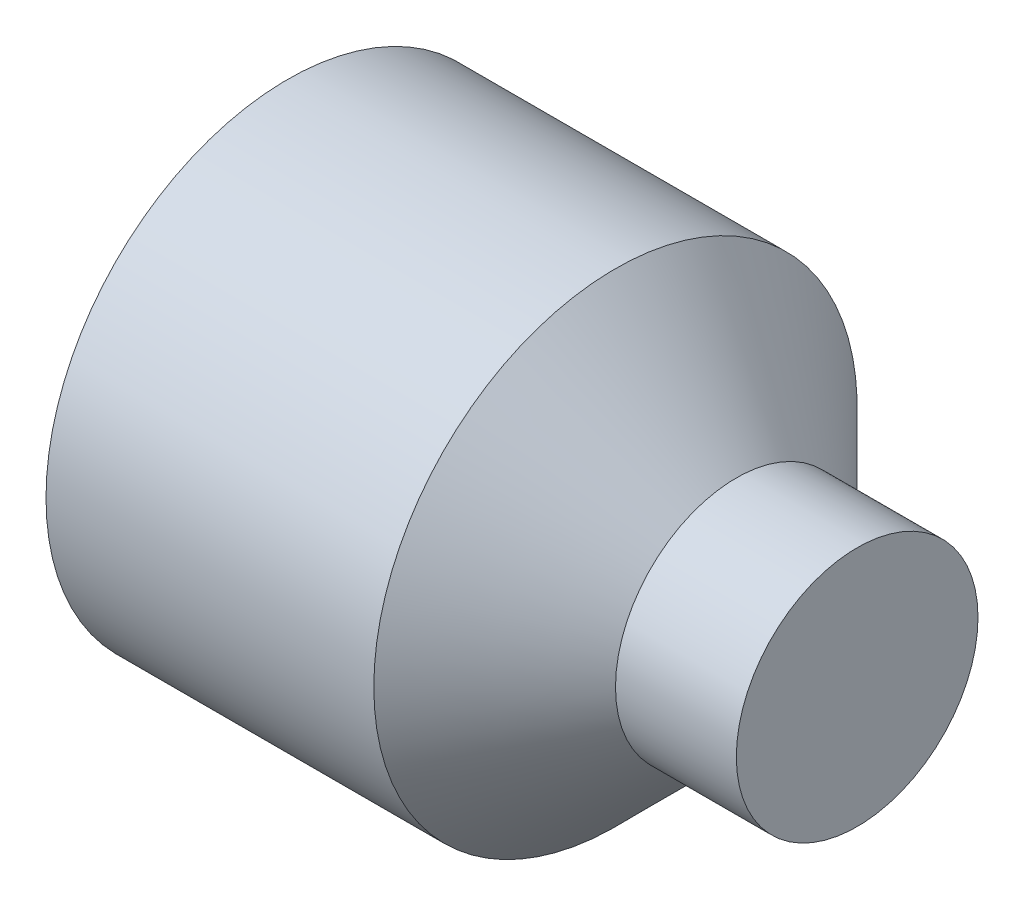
ISO-10303-21;
HEADER;
FILE_DESCRIPTION(('STEP AP214'),'2;1');
FILE_NAME('part.step','',(''),(''),'','','');
FILE_SCHEMA(('AUTOMOTIVE_DESIGN { 1 0 10303 214 1 1 1 1 }'));
ENDSEC;
DATA;
#1=APPLICATION_CONTEXT('core data for automotive mechanical design processes');
#2=APPLICATION_PROTOCOL_DEFINITION('international standard','automotive_design',2000,#1);
#3=PRODUCT_CONTEXT('',#1,'mechanical');
#4=PRODUCT('Part','Part','',(#3));
#5=PRODUCT_RELATED_PRODUCT_CATEGORY('part','',(#4));
#6=PRODUCT_DEFINITION_FORMATION('','',#4);
#7=PRODUCT_DEFINITION_CONTEXT('part definition',#1,'design');
#8=PRODUCT_DEFINITION('design','',#6,#7);
#9=PRODUCT_DEFINITION_SHAPE('','',#8);
#10=(LENGTH_UNIT() NAMED_UNIT(*) SI_UNIT(.MILLI.,.METRE.));
#11=(NAMED_UNIT(*) PLANE_ANGLE_UNIT() SI_UNIT($,.RADIAN.));
#12=(NAMED_UNIT(*) SI_UNIT($,.STERADIAN.) SOLID_ANGLE_UNIT());
#13=UNCERTAINTY_MEASURE_WITH_UNIT(LENGTH_MEASURE(1.E-05),#10,'distance_accuracy_value','');
#14=(GEOMETRIC_REPRESENTATION_CONTEXT(3) GLOBAL_UNCERTAINTY_ASSIGNED_CONTEXT((#13)) GLOBAL_UNIT_ASSIGNED_CONTEXT((#10,
#11,#12)) REPRESENTATION_CONTEXT('',''));
#15=CARTESIAN_POINT('',(0.,0.,0.));
#16=DIRECTION('',(0.,0.,1.));
#17=DIRECTION('',(1.,0.,0.));
#18=AXIS2_PLACEMENT_3D('',#15,#16,#17);
#19=CARTESIAN_POINT('',(0.,0.,0.));
#20=DIRECTION('',(-1.,0.,0.));
#21=DIRECTION('',(0.,0.,1.));
#22=AXIS2_PLACEMENT_3D('',#19,#20,#21);
#23=CYLINDRICAL_SURFACE('',#22,0.799999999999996);
#24=CARTESIAN_POINT('',(1.2,0.,0.));
#25=DIRECTION('',(-1.,0.,0.));
#26=DIRECTION('',(0.,0.,1.));
#27=AXIS2_PLACEMENT_3D('',#24,#25,#26);
#28=CIRCLE('',#27,0.8);
#29=CARTESIAN_POINT('',(1.2,0.,0.8));
#30=VERTEX_POINT('',#29);
#31=EDGE_CURVE('E11',#30,#30,#28,.T.);
#32=ORIENTED_EDGE('',*,*,#31,.T.);
#33=EDGE_LOOP('',(#32));
#34=FACE_BOUND('',#33,.T.);
#35=CARTESIAN_POINT('',(0.114892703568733,0.,0.));
#36=DIRECTION('',(-1.,0.,0.));
#37=DIRECTION('',(0.,0.,1.));
#38=AXIS2_PLACEMENT_3D('',#35,#36,#37);
#39=CIRCLE('',#38,0.799999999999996);
#40=CARTESIAN_POINT('',(0.114892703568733,0.,0.799999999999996));
#41=VERTEX_POINT('',#40);
#42=EDGE_CURVE('E151',#41,#41,#39,.T.);
#43=ORIENTED_EDGE('',*,*,#42,.F.);
#44=EDGE_LOOP('',(#43));
#45=FACE_BOUND('',#44,.T.);
#46=ADVANCED_FACE('F44',(#34,#45),#23,.T.);
#47=CARTESIAN_POINT('',(1.6,0.,0.));
#48=DIRECTION('',(-1.,0.,0.));
#49=DIRECTION('',(0.,0.,1.));
#50=AXIS2_PLACEMENT_3D('',#47,#48,#49);
#51=CONICAL_SURFACE('',#50,0.4,0.78539816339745);
#52=ORIENTED_EDGE('',*,*,#31,.F.);
#53=EDGE_LOOP('',(#52));
#54=FACE_BOUND('',#53,.T.);
#55=CARTESIAN_POINT('',(1.6,0.,0.));
#56=DIRECTION('',(-1.,0.,0.));
#57=DIRECTION('',(0.,0.,1.));
#58=AXIS2_PLACEMENT_3D('',#55,#56,#57);
#59=CIRCLE('',#58,0.4);
#60=CARTESIAN_POINT('',(1.6,0.,0.4));
#61=VERTEX_POINT('',#60);
#62=EDGE_CURVE('E52',#61,#61,#59,.T.);
#63=ORIENTED_EDGE('',*,*,#62,.T.);
#64=EDGE_LOOP('',(#63));
#65=FACE_BOUND('',#64,.T.);
#66=ADVANCED_FACE('F161',(#54,#65),#51,.T.);
#67=CARTESIAN_POINT('',(0.,0.,0.));
#68=DIRECTION('',(-1.,0.,0.));
#69=DIRECTION('',(0.,0.,1.));
#70=AXIS2_PLACEMENT_3D('',#67,#68,#69);
#71=CYLINDRICAL_SURFACE('',#70,0.4);
#72=ORIENTED_EDGE('',*,*,#62,.F.);
#73=EDGE_LOOP('',(#72));
#74=FACE_BOUND('',#73,.T.);
#75=CARTESIAN_POINT('',(2.,0.,0.));
#76=DIRECTION('',(-1.,0.,0.));
#77=DIRECTION('',(0.,0.,1.));
#78=AXIS2_PLACEMENT_3D('',#75,#76,#77);
#79=CIRCLE('',#78,0.4);
#80=CARTESIAN_POINT('',(2.,0.,0.4));
#81=VERTEX_POINT('',#80);
#82=EDGE_CURVE('E157',#81,#81,#79,.T.);
#83=ORIENTED_EDGE('',*,*,#82,.T.);
#84=EDGE_LOOP('',(#83));
#85=FACE_BOUND('',#84,.T.);
#86=ADVANCED_FACE('F164',(#74,#85),#71,.T.);
#87=CARTESIAN_POINT('',(2.,0.,0.));
#88=DIRECTION('',(-1.,0.,0.));
#89=DIRECTION('',(0.,0.,1.));
#90=AXIS2_PLACEMENT_3D('',#87,#88,#89);
#91=PLANE('',#90);
#92=ORIENTED_EDGE('',*,*,#82,.F.);
#93=EDGE_LOOP('',(#92));
#94=FACE_BOUND('',#93,.T.);
#95=ADVANCED_FACE('F166',(#94),#91,.F.);
#96=CARTESIAN_POINT('',(0.,0.,0.));
#97=DIRECTION('',(1.,0.,0.));
#98=DIRECTION('',(0.,0.,-1.));
#99=AXIS2_PLACEMENT_3D('',#96,#97,#98);
#100=CONICAL_SURFACE('',#99,0.601,1.0471975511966);
#101=ORIENTED_EDGE('',*,*,#42,.T.);
#102=EDGE_LOOP('',(#101));
#103=FACE_BOUND('',#102,.T.);
#104=CARTESIAN_POINT('',(0.,0.,0.));
#105=DIRECTION('',(-1.,0.,0.));
#106=DIRECTION('',(0.,0.,1.));
#107=AXIS2_PLACEMENT_3D('',#104,#105,#106);
#108=CIRCLE('',#107,0.601);
#109=CARTESIAN_POINT('',(0.,0.,0.601));
#110=VERTEX_POINT('',#109);
#111=EDGE_CURVE('E149',#110,#110,#108,.T.);
#112=ORIENTED_EDGE('',*,*,#111,.F.);
#113=EDGE_LOOP('',(#112));
#114=FACE_BOUND('',#113,.T.);
#115=ADVANCED_FACE('F173',(#103,#114),#100,.T.);
#116=CARTESIAN_POINT('',(0.,0.799999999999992,0.));
#117=DIRECTION('',(1.,0.,0.));
#118=DIRECTION('',(0.,0.,-1.));
#119=AXIS2_PLACEMENT_3D('',#116,#117,#118);
#120=PLANE('',#119);
#121=DIRECTION('',(0.,-0.5,-0.866025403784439));
#122=VECTOR('',#121,1.);
#123=CARTESIAN_POINT('',(0.,0.404145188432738,0.));
#124=LINE('',#123,#122);
#125=CARTESIAN_POINT('',(0.,0.404145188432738,0.));
#126=VERTEX_POINT('',#125);
#127=CARTESIAN_POINT('',(0.,0.202072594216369,-0.35));
#128=VERTEX_POINT('',#127);
#129=EDGE_CURVE('E135',#126,#128,#124,.T.);
#130=ORIENTED_EDGE('',*,*,#129,.F.);
#131=DIRECTION('',(0.,0.5,-0.866025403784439));
#132=VECTOR('',#131,1.);
#133=CARTESIAN_POINT('',(0.,0.202072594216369,0.35));
#134=LINE('',#133,#132);
#135=CARTESIAN_POINT('',(0.,0.202072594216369,0.35));
#136=VERTEX_POINT('',#135);
#137=EDGE_CURVE('E58',#136,#126,#134,.T.);
#138=ORIENTED_EDGE('',*,*,#137,.F.);
#139=DIRECTION('',(0.,1.,0.));
#140=VECTOR('',#139,1.);
#141=CARTESIAN_POINT('',(0.,-0.202072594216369,0.35));
#142=LINE('',#141,#140);
#143=CARTESIAN_POINT('',(0.,-0.202072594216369,0.35));
#144=VERTEX_POINT('',#143);
#145=EDGE_CURVE('E141',#144,#136,#142,.T.);
#146=ORIENTED_EDGE('',*,*,#145,.F.);
#147=DIRECTION('',(0.,0.5,0.866025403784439));
#148=VECTOR('',#147,1.);
#149=CARTESIAN_POINT('',(0.,-0.404145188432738,0.));
#150=LINE('',#149,#148);
#151=CARTESIAN_POINT('',(0.,-0.404145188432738,0.));
#152=VERTEX_POINT('',#151);
#153=EDGE_CURVE('E142',#152,#144,#150,.T.);
#154=ORIENTED_EDGE('',*,*,#153,.F.);
#155=DIRECTION('',(0.,-0.5,0.866025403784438));
#156=VECTOR('',#155,1.);
#157=CARTESIAN_POINT('',(0.,-0.202072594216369,-0.35));
#158=LINE('',#157,#156);
#159=CARTESIAN_POINT('',(0.,-0.202072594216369,-0.35));
#160=VERTEX_POINT('',#159);
#161=EDGE_CURVE('E108',#160,#152,#158,.T.);
#162=ORIENTED_EDGE('',*,*,#161,.F.);
#163=DIRECTION('',(0.,-1.,0.));
#164=VECTOR('',#163,1.);
#165=CARTESIAN_POINT('',(0.,0.202072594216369,-0.35));
#166=LINE('',#165,#164);
#167=EDGE_CURVE('E140',#128,#160,#166,.T.);
#168=ORIENTED_EDGE('',*,*,#167,.F.);
#169=EDGE_LOOP('',(#130,#138,#146,#154,#162,#168));
#170=FACE_BOUND('',#169,.T.);
#171=ORIENTED_EDGE('',*,*,#111,.T.);
#172=EDGE_LOOP('',(#171));
#173=FACE_BOUND('',#172,.T.);
#174=ADVANCED_FACE('F50',(#170,#173),#120,.F.);
#175=CARTESIAN_POINT('',(0.7,0.202072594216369,0.35));
#176=DIRECTION('',(0.,0.866025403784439,0.5));
#177=DIRECTION('',(0.,-0.5,0.866025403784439));
#178=AXIS2_PLACEMENT_3D('',#175,#176,#177);
#179=PLANE('',#178);
#180=ORIENTED_EDGE('',*,*,#137,.T.);
#181=DIRECTION('',(-1.,0.,0.));
#182=VECTOR('',#181,1.);
#183=CARTESIAN_POINT('',(0.7,0.404145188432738,0.));
#184=LINE('',#183,#182);
#185=CARTESIAN_POINT('',(0.7,0.404145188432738,0.));
#186=VERTEX_POINT('',#185);
#187=EDGE_CURVE('E86',#186,#126,#184,.T.);
#188=ORIENTED_EDGE('',*,*,#187,.F.);
#189=DIRECTION('',(0.,0.5,-0.866025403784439));
#190=VECTOR('',#189,1.);
#191=CARTESIAN_POINT('',(0.7,0.202072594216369,0.35));
#192=LINE('',#191,#190);
#193=CARTESIAN_POINT('',(0.7,0.202072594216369,0.35));
#194=VERTEX_POINT('',#193);
#195=EDGE_CURVE('E143',#194,#186,#192,.T.);
#196=ORIENTED_EDGE('',*,*,#195,.F.);
#197=DIRECTION('',(-1.,0.,0.));
#198=VECTOR('',#197,1.);
#199=CARTESIAN_POINT('',(0.7,0.202072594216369,0.35));
#200=LINE('',#199,#198);
#201=EDGE_CURVE('E67',#194,#136,#200,.T.);
#202=ORIENTED_EDGE('',*,*,#201,.T.);
#203=EDGE_LOOP('',(#180,#188,#196,#202));
#204=FACE_BOUND('',#203,.T.);
#205=ADVANCED_FACE('F191',(#204),#179,.F.);
#206=CARTESIAN_POINT('',(0.7,-0.202072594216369,0.35));
#207=DIRECTION('',(0.,0.,1.));
#208=DIRECTION('',(0.,-1.,0.));
#209=AXIS2_PLACEMENT_3D('',#206,#207,#208);
#210=PLANE('',#209);
#211=ORIENTED_EDGE('',*,*,#145,.T.);
#212=ORIENTED_EDGE('',*,*,#201,.F.);
#213=DIRECTION('',(0.,1.,0.));
#214=VECTOR('',#213,1.);
#215=CARTESIAN_POINT('',(0.7,-0.202072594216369,0.35));
#216=LINE('',#215,#214);
#217=CARTESIAN_POINT('',(0.7,-0.202072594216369,0.35));
#218=VERTEX_POINT('',#217);
#219=EDGE_CURVE('E119',#218,#194,#216,.T.);
#220=ORIENTED_EDGE('',*,*,#219,.F.);
#221=DIRECTION('',(-1.,0.,0.));
#222=VECTOR('',#221,1.);
#223=CARTESIAN_POINT('',(0.7,-0.202072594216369,0.35));
#224=LINE('',#223,#222);
#225=EDGE_CURVE('E115',#218,#144,#224,.T.);
#226=ORIENTED_EDGE('',*,*,#225,.T.);
#227=EDGE_LOOP('',(#211,#212,#220,#226));
#228=FACE_BOUND('',#227,.T.);
#229=ADVANCED_FACE('F196',(#228),#210,.F.);
#230=CARTESIAN_POINT('',(0.7,-0.404145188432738,0.));
#231=DIRECTION('',(0.,-0.866025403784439,0.5));
#232=DIRECTION('',(0.,-0.5,-0.866025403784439));
#233=AXIS2_PLACEMENT_3D('',#230,#231,#232);
#234=PLANE('',#233);
#235=ORIENTED_EDGE('',*,*,#153,.T.);
#236=ORIENTED_EDGE('',*,*,#225,.F.);
#237=DIRECTION('',(0.,0.5,0.866025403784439));
#238=VECTOR('',#237,1.);
#239=CARTESIAN_POINT('',(0.7,-0.404145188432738,0.));
#240=LINE('',#239,#238);
#241=CARTESIAN_POINT('',(0.7,-0.404145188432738,0.));
#242=VERTEX_POINT('',#241);
#243=EDGE_CURVE('E116',#242,#218,#240,.T.);
#244=ORIENTED_EDGE('',*,*,#243,.F.);
#245=DIRECTION('',(-1.,0.,0.));
#246=VECTOR('',#245,1.);
#247=CARTESIAN_POINT('',(0.7,-0.404145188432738,0.));
#248=LINE('',#247,#246);
#249=EDGE_CURVE('E103',#242,#152,#248,.T.);
#250=ORIENTED_EDGE('',*,*,#249,.T.);
#251=EDGE_LOOP('',(#235,#236,#244,#250));
#252=FACE_BOUND('',#251,.T.);
#253=ADVANCED_FACE('F120',(#252),#234,.F.);
#254=CARTESIAN_POINT('',(0.7,-0.202072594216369,-0.35));
#255=DIRECTION('',(0.,-0.866025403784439,-0.5));
#256=DIRECTION('',(0.,0.5,-0.866025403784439));
#257=AXIS2_PLACEMENT_3D('',#254,#255,#256);
#258=PLANE('',#257);
#259=ORIENTED_EDGE('',*,*,#161,.T.);
#260=ORIENTED_EDGE('',*,*,#249,.F.);
#261=DIRECTION('',(0.,-0.5,0.866025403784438));
#262=VECTOR('',#261,1.);
#263=CARTESIAN_POINT('',(0.7,-0.202072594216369,-0.35));
#264=LINE('',#263,#262);
#265=CARTESIAN_POINT('',(0.7,-0.202072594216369,-0.35));
#266=VERTEX_POINT('',#265);
#267=EDGE_CURVE('E102',#266,#242,#264,.T.);
#268=ORIENTED_EDGE('',*,*,#267,.F.);
#269=DIRECTION('',(-1.,0.,0.));
#270=VECTOR('',#269,1.);
#271=CARTESIAN_POINT('',(0.7,-0.202072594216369,-0.35));
#272=LINE('',#271,#270);
#273=EDGE_CURVE('E113',#266,#160,#272,.T.);
#274=ORIENTED_EDGE('',*,*,#273,.T.);
#275=EDGE_LOOP('',(#259,#260,#268,#274));
#276=FACE_BOUND('',#275,.T.);
#277=ADVANCED_FACE('F101',(#276),#258,.F.);
#278=CARTESIAN_POINT('',(0.7,0.202072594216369,-0.35));
#279=DIRECTION('',(0.,0.,-1.));
#280=DIRECTION('',(-1.,0.,0.));
#281=AXIS2_PLACEMENT_3D('',#278,#279,#280);
#282=PLANE('',#281);
#283=ORIENTED_EDGE('',*,*,#167,.T.);
#284=ORIENTED_EDGE('',*,*,#273,.F.);
#285=DIRECTION('',(0.,-1.,0.));
#286=VECTOR('',#285,1.);
#287=CARTESIAN_POINT('',(0.7,0.202072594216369,-0.35));
#288=LINE('',#287,#286);
#289=CARTESIAN_POINT('',(0.7,0.202072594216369,-0.35));
#290=VERTEX_POINT('',#289);
#291=EDGE_CURVE('E128',#290,#266,#288,.T.);
#292=ORIENTED_EDGE('',*,*,#291,.F.);
#293=DIRECTION('',(-1.,0.,0.));
#294=VECTOR('',#293,1.);
#295=CARTESIAN_POINT('',(0.7,0.202072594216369,-0.35));
#296=LINE('',#295,#294);
#297=EDGE_CURVE('E146',#290,#128,#296,.T.);
#298=ORIENTED_EDGE('',*,*,#297,.T.);
#299=EDGE_LOOP('',(#283,#284,#292,#298));
#300=FACE_BOUND('',#299,.T.);
#301=ADVANCED_FACE('F217',(#300),#282,.F.);
#302=CARTESIAN_POINT('',(0.7,0.404145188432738,0.));
#303=DIRECTION('',(0.,0.866025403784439,-0.5));
#304=DIRECTION('',(0.,0.5,0.866025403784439));
#305=AXIS2_PLACEMENT_3D('',#302,#303,#304);
#306=PLANE('',#305);
#307=ORIENTED_EDGE('',*,*,#129,.T.);
#308=ORIENTED_EDGE('',*,*,#297,.F.);
#309=DIRECTION('',(0.,-0.5,-0.866025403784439));
#310=VECTOR('',#309,1.);
#311=CARTESIAN_POINT('',(0.7,0.404145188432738,0.));
#312=LINE('',#311,#310);
#313=EDGE_CURVE('E127',#186,#290,#312,.T.);
#314=ORIENTED_EDGE('',*,*,#313,.F.);
#315=ORIENTED_EDGE('',*,*,#187,.T.);
#316=EDGE_LOOP('',(#307,#308,#314,#315));
#317=FACE_BOUND('',#316,.T.);
#318=ADVANCED_FACE('F207',(#317),#306,.F.);
#319=CARTESIAN_POINT('',(0.7,0.202072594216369,0.35));
#320=DIRECTION('',(1.,0.,0.));
#321=DIRECTION('',(0.,0.,-1.));
#322=AXIS2_PLACEMENT_3D('',#319,#320,#321);
#323=PLANE('',#322);
#324=ORIENTED_EDGE('',*,*,#195,.T.);
#325=ORIENTED_EDGE('',*,*,#313,.T.);
#326=ORIENTED_EDGE('',*,*,#291,.T.);
#327=ORIENTED_EDGE('',*,*,#267,.T.);
#328=ORIENTED_EDGE('',*,*,#243,.T.);
#329=ORIENTED_EDGE('',*,*,#219,.T.);
#330=EDGE_LOOP('',(#324,#325,#326,#327,#328,#329));
#331=FACE_BOUND('',#330,.T.);
#332=ADVANCED_FACE('F124',(#331),#323,.F.);
#333=CLOSED_SHELL('',(#46,#66,#86,#95,#115,#174,#205,#229,#253,#277,#301,#318,#332));
#334=MANIFOLD_SOLID_BREP('B2',#333);
#335=ADVANCED_BREP_SHAPE_REPRESENTATION('',(#18,#334),#14);
#336=SHAPE_DEFINITION_REPRESENTATION(#9,#335);
ENDSEC;
END-ISO-10303-21;
